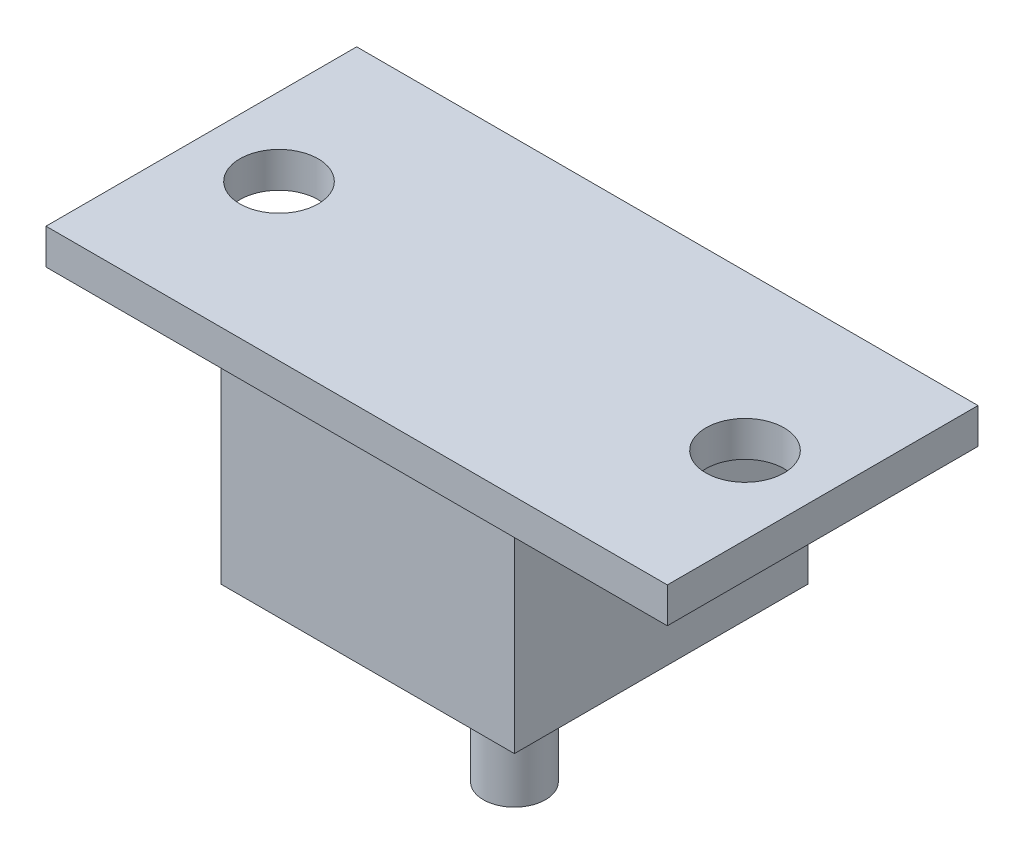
ISO-10303-21;
HEADER;
FILE_DESCRIPTION(('STEP AP214'),'2;1');
FILE_NAME('part.step','',(''),(''),'','','');
FILE_SCHEMA(('AUTOMOTIVE_DESIGN { 1 0 10303 214 1 1 1 1 }'));
ENDSEC;
DATA;
#1=APPLICATION_CONTEXT('core data for automotive mechanical design processes');
#2=APPLICATION_PROTOCOL_DEFINITION('international standard','automotive_design',2000,#1);
#3=PRODUCT_CONTEXT('',#1,'mechanical');
#4=PRODUCT('Part','Part','',(#3));
#5=PRODUCT_RELATED_PRODUCT_CATEGORY('part','',(#4));
#6=PRODUCT_DEFINITION_FORMATION('','',#4);
#7=PRODUCT_DEFINITION_CONTEXT('part definition',#1,'design');
#8=PRODUCT_DEFINITION('design','',#6,#7);
#9=PRODUCT_DEFINITION_SHAPE('','',#8);
#10=(LENGTH_UNIT() NAMED_UNIT(*) SI_UNIT(.MILLI.,.METRE.));
#11=(NAMED_UNIT(*) PLANE_ANGLE_UNIT() SI_UNIT($,.RADIAN.));
#12=(NAMED_UNIT(*) SI_UNIT($,.STERADIAN.) SOLID_ANGLE_UNIT());
#13=UNCERTAINTY_MEASURE_WITH_UNIT(LENGTH_MEASURE(1.E-05),#10,'distance_accuracy_value','');
#14=(GEOMETRIC_REPRESENTATION_CONTEXT(3) GLOBAL_UNCERTAINTY_ASSIGNED_CONTEXT((#13)) GLOBAL_UNIT_ASSIGNED_CONTEXT((#10,
#11,#12)) REPRESENTATION_CONTEXT('',''));
#15=CARTESIAN_POINT('',(0.,0.,0.));
#16=DIRECTION('',(0.,0.,1.));
#17=DIRECTION('',(1.,0.,0.));
#18=AXIS2_PLACEMENT_3D('',#15,#16,#17);
#19=CARTESIAN_POINT('',(0.,0.,0.));
#20=DIRECTION('',(0.,-1.,0.));
#21=DIRECTION('',(0.,0.,-1.));
#22=AXIS2_PLACEMENT_3D('',#19,#20,#21);
#23=PLANE('',#22);
#24=DIRECTION('',(0.,0.,1.));
#25=VECTOR('',#24,1.);
#26=CARTESIAN_POINT('',(0.,0.,0.));
#27=LINE('',#26,#25);
#28=CARTESIAN_POINT('',(0.,0.,-12.7));
#29=VERTEX_POINT('',#28);
#30=CARTESIAN_POINT('',(0.,0.,0.));
#31=VERTEX_POINT('',#30);
#32=EDGE_CURVE('E156',#29,#31,#27,.T.);
#33=ORIENTED_EDGE('',*,*,#32,.F.);
#34=DIRECTION('',(-1.,0.,0.));
#35=VECTOR('',#34,1.);
#36=CARTESIAN_POINT('',(0.,0.,-12.7));
#37=LINE('',#36,#35);
#38=CARTESIAN_POINT('',(25.4,0.,-12.7));
#39=VERTEX_POINT('',#38);
#40=EDGE_CURVE('E86',#39,#29,#37,.T.);
#41=ORIENTED_EDGE('',*,*,#40,.F.);
#42=DIRECTION('',(0.,0.,-1.));
#43=VECTOR('',#42,1.);
#44=CARTESIAN_POINT('',(25.4,0.,0.));
#45=LINE('',#44,#43);
#46=CARTESIAN_POINT('',(25.4,0.,0.));
#47=VERTEX_POINT('',#46);
#48=EDGE_CURVE('E168',#47,#39,#45,.T.);
#49=ORIENTED_EDGE('',*,*,#48,.F.);
#50=DIRECTION('',(1.,0.,0.));
#51=VECTOR('',#50,1.);
#52=CARTESIAN_POINT('',(0.,0.,0.));
#53=LINE('',#52,#51);
#54=EDGE_CURVE('E166',#31,#47,#53,.T.);
#55=ORIENTED_EDGE('',*,*,#54,.F.);
#56=EDGE_LOOP('',(#33,#41,#49,#55));
#57=FACE_BOUND('',#56,.T.);
#58=CARTESIAN_POINT('',(22.225,0.,-6.35));
#59=DIRECTION('',(0.,1.,0.));
#60=DIRECTION('',(0.,0.,1.));
#61=AXIS2_PLACEMENT_3D('',#58,#59,#60);
#62=CIRCLE('',#61,1.6);
#63=CARTESIAN_POINT('',(22.225,0.,-4.75));
#64=VERTEX_POINT('',#63);
#65=EDGE_CURVE('E153',#64,#64,#62,.T.);
#66=ORIENTED_EDGE('',*,*,#65,.T.);
#67=EDGE_LOOP('',(#66));
#68=FACE_BOUND('',#67,.T.);
#69=CARTESIAN_POINT('',(3.175,0.,-6.35));
#70=DIRECTION('',(0.,1.,0.));
#71=DIRECTION('',(0.,0.,1.));
#72=AXIS2_PLACEMENT_3D('',#69,#70,#71);
#73=CIRCLE('',#72,1.6);
#74=CARTESIAN_POINT('',(3.175,0.,-4.75));
#75=VERTEX_POINT('',#74);
#76=EDGE_CURVE('E143',#75,#75,#73,.T.);
#77=ORIENTED_EDGE('',*,*,#76,.T.);
#78=EDGE_LOOP('',(#77));
#79=FACE_BOUND('',#78,.T.);
#80=DIRECTION('',(1.,0.,0.));
#81=VECTOR('',#80,1.);
#82=CARTESIAN_POINT('',(6.79945322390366,0.,-12.3492686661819));
#83=LINE('',#82,#81);
#84=CARTESIAN_POINT('',(6.79945322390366,0.,-12.3492686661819));
#85=VERTEX_POINT('',#84);
#86=CARTESIAN_POINT('',(18.7994532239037,0.,-12.3492686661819));
#87=VERTEX_POINT('',#86);
#88=EDGE_CURVE('E239',#85,#87,#83,.T.);
#89=ORIENTED_EDGE('',*,*,#88,.F.);
#90=DIRECTION('',(0.,0.,-1.));
#91=VECTOR('',#90,1.);
#92=CARTESIAN_POINT('',(6.79945322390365,0.,-0.349268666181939));
#93=LINE('',#92,#91);
#94=CARTESIAN_POINT('',(6.79945322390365,0.,-0.349268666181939));
#95=VERTEX_POINT('',#94);
#96=EDGE_CURVE('E138',#95,#85,#93,.T.);
#97=ORIENTED_EDGE('',*,*,#96,.F.);
#98=DIRECTION('',(-1.,0.,0.));
#99=VECTOR('',#98,1.);
#100=CARTESIAN_POINT('',(6.79945322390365,0.,-0.349268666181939));
#101=LINE('',#100,#99);
#102=CARTESIAN_POINT('',(18.7994532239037,0.,-0.349268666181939));
#103=VERTEX_POINT('',#102);
#104=EDGE_CURVE('E134',#103,#95,#101,.T.);
#105=ORIENTED_EDGE('',*,*,#104,.F.);
#106=DIRECTION('',(0.,0.,1.));
#107=VECTOR('',#106,1.);
#108=CARTESIAN_POINT('',(18.7994532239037,0.,-0.349268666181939));
#109=LINE('',#108,#107);
#110=EDGE_CURVE('E248',#87,#103,#109,.T.);
#111=ORIENTED_EDGE('',*,*,#110,.F.);
#112=EDGE_LOOP('',(#89,#97,#105,#111));
#113=FACE_BOUND('',#112,.T.);
#114=ADVANCED_FACE('F41',(#57,#68,#79,#113),#23,.T.);
#115=CARTESIAN_POINT('',(0.,1.4478,0.));
#116=DIRECTION('',(1.,0.,0.));
#117=DIRECTION('',(0.,0.,-1.));
#118=AXIS2_PLACEMENT_3D('',#115,#116,#117);
#119=PLANE('',#118);
#120=ORIENTED_EDGE('',*,*,#32,.T.);
#121=DIRECTION('',(0.,-1.,0.));
#122=VECTOR('',#121,1.);
#123=CARTESIAN_POINT('',(0.,1.4478,0.));
#124=LINE('',#123,#122);
#125=CARTESIAN_POINT('',(0.,1.4478,0.));
#126=VERTEX_POINT('',#125);
#127=EDGE_CURVE('E11',#126,#31,#124,.T.);
#128=ORIENTED_EDGE('',*,*,#127,.F.);
#129=DIRECTION('',(0.,0.,1.));
#130=VECTOR('',#129,1.);
#131=CARTESIAN_POINT('',(0.,1.4478,0.));
#132=LINE('',#131,#130);
#133=CARTESIAN_POINT('',(0.,1.4478,-12.7));
#134=VERTEX_POINT('',#133);
#135=EDGE_CURVE('E157',#134,#126,#132,.T.);
#136=ORIENTED_EDGE('',*,*,#135,.F.);
#137=DIRECTION('',(0.,-1.,0.));
#138=VECTOR('',#137,1.);
#139=CARTESIAN_POINT('',(0.,1.4478,-12.7));
#140=LINE('',#139,#138);
#141=EDGE_CURVE('E163',#134,#29,#140,.T.);
#142=ORIENTED_EDGE('',*,*,#141,.T.);
#143=EDGE_LOOP('',(#120,#128,#136,#142));
#144=FACE_BOUND('',#143,.T.);
#145=ADVANCED_FACE('F43',(#144),#119,.F.);
#146=CARTESIAN_POINT('',(0.,1.4478,0.));
#147=DIRECTION('',(0.,0.,-1.));
#148=DIRECTION('',(-1.,0.,0.));
#149=AXIS2_PLACEMENT_3D('',#146,#147,#148);
#150=PLANE('',#149);
#151=ORIENTED_EDGE('',*,*,#54,.T.);
#152=DIRECTION('',(0.,-1.,0.));
#153=VECTOR('',#152,1.);
#154=CARTESIAN_POINT('',(25.4,1.4478,0.));
#155=LINE('',#154,#153);
#156=CARTESIAN_POINT('',(25.4,1.4478,0.));
#157=VERTEX_POINT('',#156);
#158=EDGE_CURVE('E49',#157,#47,#155,.T.);
#159=ORIENTED_EDGE('',*,*,#158,.F.);
#160=DIRECTION('',(1.,0.,0.));
#161=VECTOR('',#160,1.);
#162=CARTESIAN_POINT('',(0.,1.4478,0.));
#163=LINE('',#162,#161);
#164=EDGE_CURVE('E93',#126,#157,#163,.T.);
#165=ORIENTED_EDGE('',*,*,#164,.F.);
#166=ORIENTED_EDGE('',*,*,#127,.T.);
#167=EDGE_LOOP('',(#151,#159,#165,#166));
#168=FACE_BOUND('',#167,.T.);
#169=ADVANCED_FACE('F196',(#168),#150,.F.);
#170=CARTESIAN_POINT('',(25.4,1.4478,0.));
#171=DIRECTION('',(-1.,0.,0.));
#172=DIRECTION('',(0.,0.,1.));
#173=AXIS2_PLACEMENT_3D('',#170,#171,#172);
#174=PLANE('',#173);
#175=ORIENTED_EDGE('',*,*,#48,.T.);
#176=DIRECTION('',(0.,-1.,0.));
#177=VECTOR('',#176,1.);
#178=CARTESIAN_POINT('',(25.4,1.4478,-12.7));
#179=LINE('',#178,#177);
#180=CARTESIAN_POINT('',(25.4,1.4478,-12.7));
#181=VERTEX_POINT('',#180);
#182=EDGE_CURVE('E172',#181,#39,#179,.T.);
#183=ORIENTED_EDGE('',*,*,#182,.F.);
#184=DIRECTION('',(0.,0.,-1.));
#185=VECTOR('',#184,1.);
#186=CARTESIAN_POINT('',(25.4,1.4478,0.));
#187=LINE('',#186,#185);
#188=EDGE_CURVE('E160',#157,#181,#187,.T.);
#189=ORIENTED_EDGE('',*,*,#188,.F.);
#190=ORIENTED_EDGE('',*,*,#158,.T.);
#191=EDGE_LOOP('',(#175,#183,#189,#190));
#192=FACE_BOUND('',#191,.T.);
#193=ADVANCED_FACE('F177',(#192),#174,.F.);
#194=CARTESIAN_POINT('',(0.,1.4478,-12.7));
#195=DIRECTION('',(0.,0.,1.));
#196=DIRECTION('',(1.,0.,0.));
#197=AXIS2_PLACEMENT_3D('',#194,#195,#196);
#198=PLANE('',#197);
#199=ORIENTED_EDGE('',*,*,#40,.T.);
#200=ORIENTED_EDGE('',*,*,#141,.F.);
#201=DIRECTION('',(-1.,0.,0.));
#202=VECTOR('',#201,1.);
#203=CARTESIAN_POINT('',(0.,1.4478,-12.7));
#204=LINE('',#203,#202);
#205=EDGE_CURVE('E65',#181,#134,#204,.T.);
#206=ORIENTED_EDGE('',*,*,#205,.F.);
#207=ORIENTED_EDGE('',*,*,#182,.T.);
#208=EDGE_LOOP('',(#199,#200,#206,#207));
#209=FACE_BOUND('',#208,.T.);
#210=ADVANCED_FACE('F185',(#209),#198,.F.);
#211=CARTESIAN_POINT('',(0.,1.4478,0.));
#212=DIRECTION('',(0.,-1.,0.));
#213=DIRECTION('',(0.,0.,-1.));
#214=AXIS2_PLACEMENT_3D('',#211,#212,#213);
#215=PLANE('',#214);
#216=CARTESIAN_POINT('',(3.175,1.4478,-6.35));
#217=DIRECTION('',(0.,1.,0.));
#218=DIRECTION('',(0.,0.,1.));
#219=AXIS2_PLACEMENT_3D('',#216,#217,#218);
#220=CIRCLE('',#219,1.6);
#221=CARTESIAN_POINT('',(3.175,1.4478,-4.75));
#222=VERTEX_POINT('',#221);
#223=EDGE_CURVE('E140',#222,#222,#220,.T.);
#224=ORIENTED_EDGE('',*,*,#223,.F.);
#225=EDGE_LOOP('',(#224));
#226=FACE_BOUND('',#225,.T.);
#227=CARTESIAN_POINT('',(22.225,1.4478,-6.35));
#228=DIRECTION('',(0.,1.,0.));
#229=DIRECTION('',(0.,0.,1.));
#230=AXIS2_PLACEMENT_3D('',#227,#228,#229);
#231=CIRCLE('',#230,1.6);
#232=CARTESIAN_POINT('',(22.225,1.4478,-4.75));
#233=VERTEX_POINT('',#232);
#234=EDGE_CURVE('E150',#233,#233,#231,.T.);
#235=ORIENTED_EDGE('',*,*,#234,.F.);
#236=EDGE_LOOP('',(#235));
#237=FACE_BOUND('',#236,.T.);
#238=ORIENTED_EDGE('',*,*,#135,.T.);
#239=ORIENTED_EDGE('',*,*,#164,.T.);
#240=ORIENTED_EDGE('',*,*,#188,.T.);
#241=ORIENTED_EDGE('',*,*,#205,.T.);
#242=EDGE_LOOP('',(#238,#239,#240,#241));
#243=FACE_BOUND('',#242,.T.);
#244=ADVANCED_FACE('F187',(#226,#237,#243),#215,.F.);
#245=CARTESIAN_POINT('',(22.225,1.4478,-6.35));
#246=DIRECTION('',(0.,1.,0.));
#247=DIRECTION('',(0.,0.,1.));
#248=AXIS2_PLACEMENT_3D('',#245,#246,#247);
#249=CYLINDRICAL_SURFACE('',#248,1.6);
#250=ORIENTED_EDGE('',*,*,#65,.F.);
#251=EDGE_LOOP('',(#250));
#252=FACE_BOUND('',#251,.T.);
#253=ORIENTED_EDGE('',*,*,#234,.T.);
#254=EDGE_LOOP('',(#253));
#255=FACE_BOUND('',#254,.T.);
#256=ADVANCED_FACE('F193',(#252,#255),#249,.F.);
#257=CARTESIAN_POINT('',(3.175,1.4478,-6.35));
#258=DIRECTION('',(0.,1.,0.));
#259=DIRECTION('',(0.,0.,1.));
#260=AXIS2_PLACEMENT_3D('',#257,#258,#259);
#261=CYLINDRICAL_SURFACE('',#260,1.6);
#262=ORIENTED_EDGE('',*,*,#76,.F.);
#263=EDGE_LOOP('',(#262));
#264=FACE_BOUND('',#263,.T.);
#265=ORIENTED_EDGE('',*,*,#223,.T.);
#266=EDGE_LOOP('',(#265));
#267=FACE_BOUND('',#266,.T.);
#268=ADVANCED_FACE('F208',(#264,#267),#261,.F.);
#269=CARTESIAN_POINT('',(6.79945322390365,-8.,-0.349268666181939));
#270=DIRECTION('',(1.,0.,0.));
#271=DIRECTION('',(0.,0.,-1.));
#272=AXIS2_PLACEMENT_3D('',#269,#270,#271);
#273=PLANE('',#272);
#274=ORIENTED_EDGE('',*,*,#96,.T.);
#275=DIRECTION('',(0.,1.,0.));
#276=VECTOR('',#275,1.);
#277=CARTESIAN_POINT('',(6.79945322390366,-8.,-12.3492686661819));
#278=LINE('',#277,#276);
#279=CARTESIAN_POINT('',(6.79945322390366,-8.,-12.3492686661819));
#280=VERTEX_POINT('',#279);
#281=EDGE_CURVE('E119',#280,#85,#278,.T.);
#282=ORIENTED_EDGE('',*,*,#281,.F.);
#283=DIRECTION('',(0.,0.,-1.));
#284=VECTOR('',#283,1.);
#285=CARTESIAN_POINT('',(6.79945322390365,-8.,-0.349268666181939));
#286=LINE('',#285,#284);
#287=CARTESIAN_POINT('',(6.79945322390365,-8.,-0.349268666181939));
#288=VERTEX_POINT('',#287);
#289=EDGE_CURVE('E126',#288,#280,#286,.T.);
#290=ORIENTED_EDGE('',*,*,#289,.F.);
#291=DIRECTION('',(0.,1.,0.));
#292=VECTOR('',#291,1.);
#293=CARTESIAN_POINT('',(6.79945322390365,-8.,-0.349268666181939));
#294=LINE('',#293,#292);
#295=EDGE_CURVE('E245',#288,#95,#294,.T.);
#296=ORIENTED_EDGE('',*,*,#295,.T.);
#297=EDGE_LOOP('',(#274,#282,#290,#296));
#298=FACE_BOUND('',#297,.T.);
#299=ADVANCED_FACE('F136',(#298),#273,.F.);
#300=CARTESIAN_POINT('',(6.79945322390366,-8.,-12.3492686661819));
#301=DIRECTION('',(0.,0.,1.));
#302=DIRECTION('',(1.,0.,0.));
#303=AXIS2_PLACEMENT_3D('',#300,#301,#302);
#304=PLANE('',#303);
#305=ORIENTED_EDGE('',*,*,#88,.T.);
#306=DIRECTION('',(0.,1.,0.));
#307=VECTOR('',#306,1.);
#308=CARTESIAN_POINT('',(18.7994532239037,-8.,-12.3492686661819));
#309=LINE('',#308,#307);
#310=CARTESIAN_POINT('',(18.7994532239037,-8.,-12.3492686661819));
#311=VERTEX_POINT('',#310);
#312=EDGE_CURVE('E122',#311,#87,#309,.T.);
#313=ORIENTED_EDGE('',*,*,#312,.F.);
#314=DIRECTION('',(1.,0.,0.));
#315=VECTOR('',#314,1.);
#316=CARTESIAN_POINT('',(6.79945322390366,-8.,-12.3492686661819));
#317=LINE('',#316,#315);
#318=EDGE_CURVE('E115',#280,#311,#317,.T.);
#319=ORIENTED_EDGE('',*,*,#318,.F.);
#320=ORIENTED_EDGE('',*,*,#281,.T.);
#321=EDGE_LOOP('',(#305,#313,#319,#320));
#322=FACE_BOUND('',#321,.T.);
#323=ADVANCED_FACE('F117',(#322),#304,.F.);
#324=CARTESIAN_POINT('',(18.7994532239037,-8.,-0.349268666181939));
#325=DIRECTION('',(-1.,0.,0.));
#326=DIRECTION('',(0.,0.,1.));
#327=AXIS2_PLACEMENT_3D('',#324,#325,#326);
#328=PLANE('',#327);
#329=ORIENTED_EDGE('',*,*,#110,.T.);
#330=DIRECTION('',(0.,1.,0.));
#331=VECTOR('',#330,1.);
#332=CARTESIAN_POINT('',(18.7994532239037,-8.,-0.349268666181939));
#333=LINE('',#332,#331);
#334=CARTESIAN_POINT('',(18.7994532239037,-8.,-0.349268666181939));
#335=VERTEX_POINT('',#334);
#336=EDGE_CURVE('E56',#335,#103,#333,.T.);
#337=ORIENTED_EDGE('',*,*,#336,.F.);
#338=DIRECTION('',(0.,0.,1.));
#339=VECTOR('',#338,1.);
#340=CARTESIAN_POINT('',(18.7994532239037,-8.,-0.349268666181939));
#341=LINE('',#340,#339);
#342=EDGE_CURVE('E125',#311,#335,#341,.T.);
#343=ORIENTED_EDGE('',*,*,#342,.F.);
#344=ORIENTED_EDGE('',*,*,#312,.T.);
#345=EDGE_LOOP('',(#329,#337,#343,#344));
#346=FACE_BOUND('',#345,.T.);
#347=ADVANCED_FACE('F215',(#346),#328,.F.);
#348=CARTESIAN_POINT('',(6.79945322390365,-8.,-0.349268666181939));
#349=DIRECTION('',(0.,0.,-1.));
#350=DIRECTION('',(-1.,0.,0.));
#351=AXIS2_PLACEMENT_3D('',#348,#349,#350);
#352=PLANE('',#351);
#353=ORIENTED_EDGE('',*,*,#104,.T.);
#354=ORIENTED_EDGE('',*,*,#295,.F.);
#355=DIRECTION('',(-1.,0.,0.));
#356=VECTOR('',#355,1.);
#357=CARTESIAN_POINT('',(6.79945322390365,-8.,-0.349268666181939));
#358=LINE('',#357,#356);
#359=EDGE_CURVE('E130',#335,#288,#358,.T.);
#360=ORIENTED_EDGE('',*,*,#359,.F.);
#361=ORIENTED_EDGE('',*,*,#336,.T.);
#362=EDGE_LOOP('',(#353,#354,#360,#361));
#363=FACE_BOUND('',#362,.T.);
#364=ADVANCED_FACE('F218',(#363),#352,.F.);
#365=CARTESIAN_POINT('',(0.,-8.,0.));
#366=DIRECTION('',(0.,-1.,0.));
#367=DIRECTION('',(0.,0.,-1.));
#368=AXIS2_PLACEMENT_3D('',#365,#366,#367);
#369=PLANE('',#368);
#370=CARTESIAN_POINT('',(12.7994532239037,-8.,-6.34926866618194));
#371=DIRECTION('',(0.,1.,0.));
#372=DIRECTION('',(0.,0.,1.));
#373=AXIS2_PLACEMENT_3D('',#370,#371,#372);
#374=CIRCLE('',#373,1.27);
#375=CARTESIAN_POINT('',(12.7994532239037,-8.,-5.07926866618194));
#376=VERTEX_POINT('',#375);
#377=EDGE_CURVE('E237',#376,#376,#374,.T.);
#378=ORIENTED_EDGE('',*,*,#377,.T.);
#379=EDGE_LOOP('',(#378));
#380=FACE_BOUND('',#379,.T.);
#381=ORIENTED_EDGE('',*,*,#289,.T.);
#382=ORIENTED_EDGE('',*,*,#318,.T.);
#383=ORIENTED_EDGE('',*,*,#342,.T.);
#384=ORIENTED_EDGE('',*,*,#359,.T.);
#385=EDGE_LOOP('',(#381,#382,#383,#384));
#386=FACE_BOUND('',#385,.T.);
#387=ADVANCED_FACE('F129',(#380,#386),#369,.T.);
#388=CARTESIAN_POINT('',(12.7994532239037,-15.,-6.34926866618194));
#389=DIRECTION('',(0.,1.,0.));
#390=DIRECTION('',(0.,0.,1.));
#391=AXIS2_PLACEMENT_3D('',#388,#389,#390);
#392=CYLINDRICAL_SURFACE('',#391,1.27);
#393=CARTESIAN_POINT('',(12.7994532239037,-15.,-6.34926866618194));
#394=DIRECTION('',(0.,1.,0.));
#395=DIRECTION('',(0.,0.,1.));
#396=AXIS2_PLACEMENT_3D('',#393,#394,#395);
#397=CIRCLE('',#396,1.27);
#398=CARTESIAN_POINT('',(12.7994532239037,-15.,-5.07926866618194));
#399=VERTEX_POINT('',#398);
#400=EDGE_CURVE('E236',#399,#399,#397,.T.);
#401=ORIENTED_EDGE('',*,*,#400,.T.);
#402=EDGE_LOOP('',(#401));
#403=FACE_BOUND('',#402,.T.);
#404=ORIENTED_EDGE('',*,*,#377,.F.);
#405=EDGE_LOOP('',(#404));
#406=FACE_BOUND('',#405,.T.);
#407=ADVANCED_FACE('F224',(#403,#406),#392,.T.);
#408=CARTESIAN_POINT('',(12.7994532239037,-15.,-6.34926866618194));
#409=DIRECTION('',(0.,1.,0.));
#410=DIRECTION('',(0.,0.,1.));
#411=AXIS2_PLACEMENT_3D('',#408,#409,#410);
#412=PLANE('',#411);
#413=ORIENTED_EDGE('',*,*,#400,.F.);
#414=EDGE_LOOP('',(#413));
#415=FACE_BOUND('',#414,.T.);
#416=ADVANCED_FACE('F228',(#415),#412,.F.);
#417=CLOSED_SHELL('',(#114,#145,#169,#193,#210,#244,#256,#268,#299,#323,#347,#364,#387,#407,#416));
#418=MANIFOLD_SOLID_BREP('B2',#417);
#419=ADVANCED_BREP_SHAPE_REPRESENTATION('',(#18,#418),#14);
#420=SHAPE_DEFINITION_REPRESENTATION(#9,#419);
ENDSEC;
END-ISO-10303-21;
